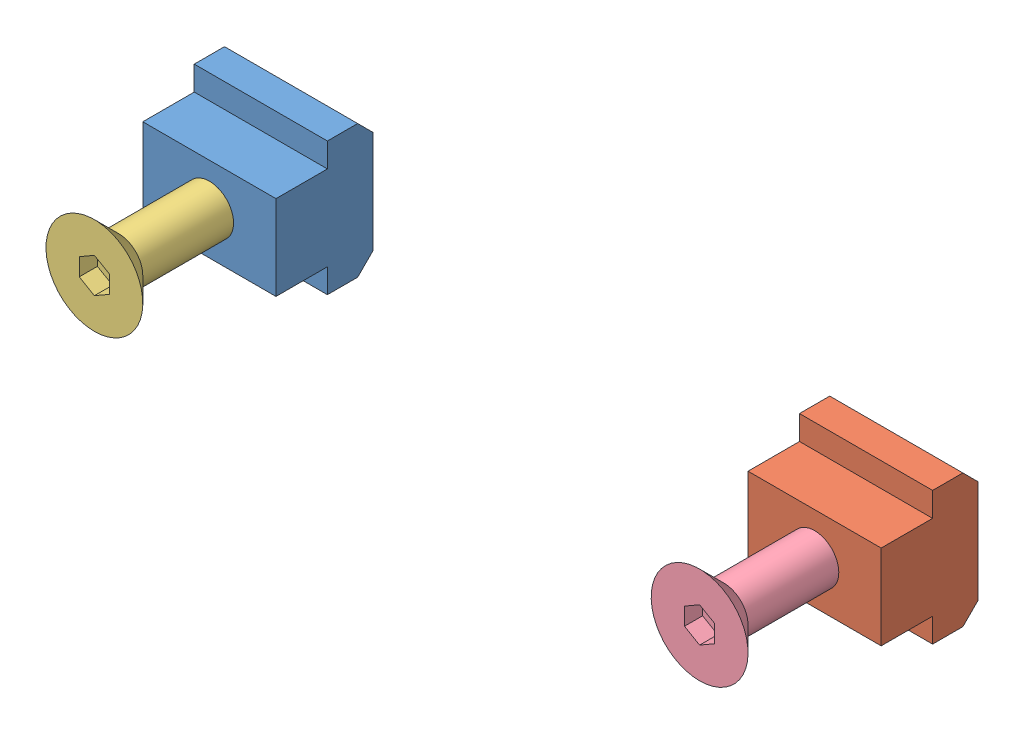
SolidWorks assembly MVAC110T14.sldasm, configuration Default (file format 15000). Lengths in mm.
Overall size (122 22 35).
4 component instances, 4 part files, 0 mates.
Components (placement in the parent):
- MVAC110T14_01-1: MVAC110T14_01.sldprt [ﾃﾞﾌｫﾙﾄ] at origin size (22 22 16)
- MVAC110T14_02-1: MVAC110T14_02.sldprt [ﾃﾞﾌｫﾙﾄ] at (100 0 0) size (22 22 16)
- MVAC110T14_03-1: MVAC110T14_03.sldprt [ﾃﾞﾌｫﾙﾄ] at (0 0 27.5) size (16 16 35)
- MVAC110T14_04-1: MVAC110T14_04.sldprt [ﾃﾞﾌｫﾙﾄ] at (100 0 27.5) size (16 16 35)
